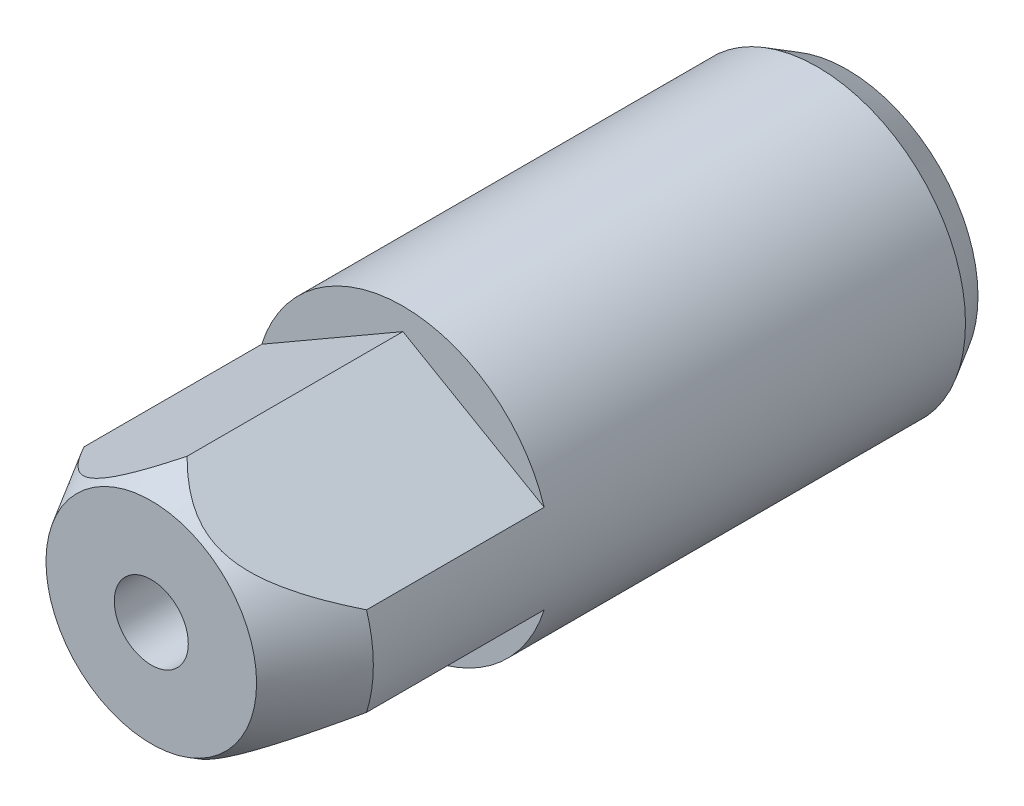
ISO-10303-21;
HEADER;
FILE_DESCRIPTION(('STEP AP214'),'2;1');
FILE_NAME('part.step','',(''),(''),'','','');
FILE_SCHEMA(('AUTOMOTIVE_DESIGN { 1 0 10303 214 1 1 1 1 }'));
ENDSEC;
DATA;
#1=APPLICATION_CONTEXT('core data for automotive mechanical design processes');
#2=APPLICATION_PROTOCOL_DEFINITION('international standard','automotive_design',2000,#1);
#3=PRODUCT_CONTEXT('',#1,'mechanical');
#4=PRODUCT('Part','Part','',(#3));
#5=PRODUCT_RELATED_PRODUCT_CATEGORY('part','',(#4));
#6=PRODUCT_DEFINITION_FORMATION('','',#4);
#7=PRODUCT_DEFINITION_CONTEXT('part definition',#1,'design');
#8=PRODUCT_DEFINITION('design','',#6,#7);
#9=PRODUCT_DEFINITION_SHAPE('','',#8);
#10=(LENGTH_UNIT() NAMED_UNIT(*) SI_UNIT(.MILLI.,.METRE.));
#11=(NAMED_UNIT(*) PLANE_ANGLE_UNIT() SI_UNIT($,.RADIAN.));
#12=(NAMED_UNIT(*) SI_UNIT($,.STERADIAN.) SOLID_ANGLE_UNIT());
#13=UNCERTAINTY_MEASURE_WITH_UNIT(LENGTH_MEASURE(1.E-05),#10,'distance_accuracy_value','');
#14=(GEOMETRIC_REPRESENTATION_CONTEXT(3) GLOBAL_UNCERTAINTY_ASSIGNED_CONTEXT((#13)) GLOBAL_UNIT_ASSIGNED_CONTEXT((#10,
#11,#12)) REPRESENTATION_CONTEXT('',''));
#15=CARTESIAN_POINT('',(0.,0.,0.));
#16=DIRECTION('',(0.,0.,1.));
#17=DIRECTION('',(1.,0.,0.));
#18=AXIS2_PLACEMENT_3D('',#15,#16,#17);
#19=CARTESIAN_POINT('',(0.,0.,42.));
#20=DIRECTION('',(0.,0.,-1.));
#21=DIRECTION('',(-1.,0.,0.));
#22=AXIS2_PLACEMENT_3D('',#19,#20,#21);
#23=CONICAL_SURFACE('',#22,10.,0.523598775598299);
#24=CARTESIAN_POINT('',(0.,0.,47.));
#25=DIRECTION('',(0.,0.,1.));
#26=DIRECTION('',(1.,0.,0.));
#27=AXIS2_PLACEMENT_3D('',#24,#25,#26);
#28=CIRCLE('',#27,7.11324865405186);
#29=CARTESIAN_POINT('',(7.11324865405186,0.,47.));
#30=VERTEX_POINT('',#29);
#31=EDGE_CURVE('E23',#30,#30,#28,.T.);
#32=ORIENTED_EDGE('',*,*,#31,.F.);
#33=EDGE_LOOP('',(#32));
#34=FACE_BOUND('',#33,.T.);
#35=CARTESIAN_POINT('',(-0.000200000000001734,8.50768601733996,44.5847636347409));
#36=CARTESIAN_POINT('',(0.0768470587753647,8.46320287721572,44.661805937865));
#37=CARTESIAN_POINT('',(0.154662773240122,8.41827595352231,44.7378208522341));
#38=CARTESIAN_POINT('',(0.312000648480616,8.32743688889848,44.8875095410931));
#39=CARTESIAN_POINT('',(0.391523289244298,8.28152447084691,44.9611826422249));
#40=CARTESIAN_POINT('',(0.633658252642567,8.14172778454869,45.1789310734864));
#41=CARTESIAN_POINT('',(0.799055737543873,8.04623550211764,45.318944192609));
#42=CARTESIAN_POINT('',(1.14278728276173,7.84778200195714,45.5881294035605));
#43=CARTESIAN_POINT('',(1.32134677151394,7.74469063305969,45.7169212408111));
#44=CARTESIAN_POINT('',(1.6881405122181,7.53292216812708,45.9539744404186));
#45=CARTESIAN_POINT('',(1.87635216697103,7.42425811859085,46.062281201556));
#46=CARTESIAN_POINT('',(2.17463746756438,7.25204301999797,46.2086042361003));
#47=CARTESIAN_POINT('',(2.28121806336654,7.1905086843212,46.256155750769));
#48=CARTESIAN_POINT('',(2.49717050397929,7.06582848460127,46.3420410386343));
#49=CARTESIAN_POINT('',(2.60654255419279,7.00268250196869,46.3803741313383));
#50=CARTESIAN_POINT('',(2.82677321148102,6.87553227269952,46.4463573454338));
#51=CARTESIAN_POINT('',(2.93761320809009,6.81153877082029,46.4740895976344));
#52=CARTESIAN_POINT('',(3.16096019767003,6.68258932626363,46.5182955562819));
#53=CARTESIAN_POINT('',(3.2734668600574,6.61763357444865,46.5347714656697));
#54=CARTESIAN_POINT('',(3.50040245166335,6.48661224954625,46.5559083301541));
#55=CARTESIAN_POINT('',(3.61483947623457,6.42054200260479,46.5604548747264));
#56=CARTESIAN_POINT('',(3.84357858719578,6.28847941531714,46.5572057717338));
#57=CARTESIAN_POINT('',(3.95788067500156,6.22248707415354,46.5494102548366));
#58=CARTESIAN_POINT('',(4.18558028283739,6.09102464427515,46.5217881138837));
#59=CARTESIAN_POINT('',(4.29897587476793,6.02555566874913,46.5019405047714));
#60=CARTESIAN_POINT('',(4.52384684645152,5.89572635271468,46.4509948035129));
#61=CARTESIAN_POINT('',(4.63532193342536,5.8313661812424,46.4198950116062));
#62=CARTESIAN_POINT('',(4.88731264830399,5.68587927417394,46.3371748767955));
#63=CARTESIAN_POINT('',(5.02700902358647,5.60522553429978,46.2822289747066));
#64=CARTESIAN_POINT('',(5.30157192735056,5.4467065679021,46.1581314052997));
#65=CARTESIAN_POINT('',(5.43643639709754,5.36884252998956,46.0889737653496));
#66=CARTESIAN_POINT('',(5.70236736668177,5.21530721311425,45.9382955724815));
#67=CARTESIAN_POINT('',(5.83338784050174,5.13966250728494,45.8566677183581));
#68=CARTESIAN_POINT('',(6.09048029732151,4.99123010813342,45.6837792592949));
#69=CARTESIAN_POINT('',(6.21655351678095,4.91844170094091,45.5925210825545));
#70=CARTESIAN_POINT('',(6.49748169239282,4.75624774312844,45.3765760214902));
#71=CARTESIAN_POINT('',(6.65095427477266,4.66764030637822,45.2495011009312));
#72=CARTESIAN_POINT('',(6.95152770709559,4.49410415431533,44.9856136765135));
#73=CARTESIAN_POINT('',(7.09862566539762,4.4091771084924,44.8487968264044));
#74=CARTESIAN_POINT('',(7.38766692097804,4.24229906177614,44.5671934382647));
#75=CARTESIAN_POINT('',(7.52959445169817,4.16035716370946,44.4223854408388));
#76=CARTESIAN_POINT('',(7.80861429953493,3.99926497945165,44.1267672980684));
#77=CARTESIAN_POINT('',(7.94570740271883,3.92011423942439,43.9759581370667));
#78=CARTESIAN_POINT('',(8.20898045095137,3.76811347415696,43.6771857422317));
#79=CARTESIAN_POINT('',(8.33536282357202,3.6951465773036,43.529459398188));
#80=CARTESIAN_POINT('',(8.5848918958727,3.55108090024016,43.2303946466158));
#81=CARTESIAN_POINT('',(8.70803835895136,3.47998225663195,43.0790559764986));
#82=CARTESIAN_POINT('',(8.95065631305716,3.33990671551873,42.7744450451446));
#83=CARTESIAN_POINT('',(9.07014739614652,3.27091850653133,42.621193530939));
#84=CARTESIAN_POINT('',(9.30664360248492,3.13437735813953,42.3122153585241));
#85=CARTESIAN_POINT('',(9.42364929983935,3.06682408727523,42.1564892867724));
#86=CARTESIAN_POINT('',(9.53959201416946,2.99988452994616,41.99972954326));
#87=B_SPLINE_CURVE_WITH_KNOTS('',3,(#35,#36,#37,#38,#39,#40,#41,#42,#43,#44,#45,#46,#47,#48,#49,
#50,#51,#52,#53,#54,#55,#56,#57,#58,#59,#60,#61,#62,#63,#64,#65,#66,#67,#68,#69,#70,#71,#72,#73,
#74,#75,#76,#77,#78,#79,#80,#81,#82,#83,#84,#85,#86),.UNSPECIFIED.,.F.,.F.,(4,2,2,2,2,2,2,2,2,2,
2,2,2,2,2,2,2,2,2,2,2,2,2,2,2,4),(0.,0.353048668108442,0.706197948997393,1.41609343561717,
2.14459244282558,2.871457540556,3.26696542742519,3.66250250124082,4.05490981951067,
4.4472403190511,4.84332000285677,5.23939549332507,5.63616261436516,6.03298969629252,
6.54338505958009,7.05399536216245,7.56927639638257,8.08442781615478,8.73817972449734,
9.39222514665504,10.0481216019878,10.7039109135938,11.3267950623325,11.9497246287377,
12.5683250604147,13.186781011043),.UNSPECIFIED.);
#88=CARTESIAN_POINT('',(0.,8.50757054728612,44.5849636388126));
#89=VERTEX_POINT('',#88);
#90=CARTESIAN_POINT('',(9.53939201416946,3.,42.));
#91=VERTEX_POINT('',#90);
#92=EDGE_CURVE('E102',#89,#91,#87,.T.);
#93=ORIENTED_EDGE('',*,*,#92,.F.);
#94=CARTESIAN_POINT('',(0.000199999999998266,8.50768601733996,44.5847636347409));
#95=CARTESIAN_POINT('',(-0.0768470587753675,8.46320287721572,44.661805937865));
#96=CARTESIAN_POINT('',(-0.154662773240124,8.41827595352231,44.7378208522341));
#97=CARTESIAN_POINT('',(-0.312000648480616,8.32743688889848,44.8875095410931));
#98=CARTESIAN_POINT('',(-0.3915232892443,8.2815244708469,44.9611826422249));
#99=CARTESIAN_POINT('',(-0.633658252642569,8.14172778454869,45.1789310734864));
#100=CARTESIAN_POINT('',(-0.799055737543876,8.04623550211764,45.318944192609));
#101=CARTESIAN_POINT('',(-1.14278728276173,7.84778200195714,45.5881294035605));
#102=CARTESIAN_POINT('',(-1.32134677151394,7.74469063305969,45.7169212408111));
#103=CARTESIAN_POINT('',(-1.68814051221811,7.53292216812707,45.9539744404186));
#104=CARTESIAN_POINT('',(-1.87635216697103,7.42425811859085,46.062281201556));
#105=CARTESIAN_POINT('',(-2.17463746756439,7.25204301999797,46.2086042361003));
#106=CARTESIAN_POINT('',(-2.28121806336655,7.19050868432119,46.256155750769));
#107=CARTESIAN_POINT('',(-2.49717050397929,7.06582848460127,46.3420410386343));
#108=CARTESIAN_POINT('',(-2.60654255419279,7.00268250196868,46.3803741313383));
#109=CARTESIAN_POINT('',(-2.82677321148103,6.87553227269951,46.4463573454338));
#110=CARTESIAN_POINT('',(-2.9376132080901,6.81153877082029,46.4740895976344));
#111=CARTESIAN_POINT('',(-3.16096019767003,6.68258932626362,46.5182955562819));
#112=CARTESIAN_POINT('',(-3.27346686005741,6.61763357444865,46.5347714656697));
#113=CARTESIAN_POINT('',(-3.50040245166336,6.48661224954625,46.5559083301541));
#114=CARTESIAN_POINT('',(-3.61483947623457,6.42054200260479,46.5604548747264));
#115=CARTESIAN_POINT('',(-3.84357858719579,6.28847941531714,46.5572057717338));
#116=CARTESIAN_POINT('',(-3.95788067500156,6.22248707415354,46.5494102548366));
#117=CARTESIAN_POINT('',(-4.1855802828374,6.09102464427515,46.5217881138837));
#118=CARTESIAN_POINT('',(-4.29897587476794,6.02555566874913,46.5019405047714));
#119=CARTESIAN_POINT('',(-4.52384684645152,5.89572635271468,46.4509948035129));
#120=CARTESIAN_POINT('',(-4.63532193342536,5.8313661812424,46.4198950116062));
#121=CARTESIAN_POINT('',(-4.88731264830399,5.68587927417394,46.3371748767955));
#122=CARTESIAN_POINT('',(-5.02700902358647,5.60522553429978,46.2822289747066));
#123=CARTESIAN_POINT('',(-5.30157192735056,5.44670656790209,46.1581314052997));
#124=CARTESIAN_POINT('',(-5.43643639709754,5.36884252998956,46.0889737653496));
#125=CARTESIAN_POINT('',(-5.70236736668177,5.21530721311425,45.9382955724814));
#126=CARTESIAN_POINT('',(-5.83338784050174,5.13966250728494,45.8566677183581));
#127=CARTESIAN_POINT('',(-6.09048029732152,4.99123010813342,45.6837792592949));
#128=CARTESIAN_POINT('',(-6.21655351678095,4.91844170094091,45.5925210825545));
#129=CARTESIAN_POINT('',(-6.49748169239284,4.75624774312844,45.3765760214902));
#130=CARTESIAN_POINT('',(-6.65095427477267,4.66764030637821,45.2495011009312));
#131=CARTESIAN_POINT('',(-6.95152770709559,4.49410415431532,44.9856136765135));
#132=CARTESIAN_POINT('',(-7.09862566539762,4.4091771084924,44.8487968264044));
#133=CARTESIAN_POINT('',(-7.38766692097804,4.24229906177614,44.5671934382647));
#134=CARTESIAN_POINT('',(-7.52959445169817,4.16035716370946,44.4223854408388));
#135=CARTESIAN_POINT('',(-7.80861429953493,3.99926497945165,44.1267672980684));
#136=CARTESIAN_POINT('',(-7.94570740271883,3.92011423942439,43.9759581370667));
#137=CARTESIAN_POINT('',(-8.20898045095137,3.76811347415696,43.6771857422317));
#138=CARTESIAN_POINT('',(-8.33536282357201,3.6951465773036,43.529459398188));
#139=CARTESIAN_POINT('',(-8.5848918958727,3.55108090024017,43.2303946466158));
#140=CARTESIAN_POINT('',(-8.70803835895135,3.47998225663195,43.0790559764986));
#141=CARTESIAN_POINT('',(-8.95065631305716,3.33990671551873,42.7744450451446));
#142=CARTESIAN_POINT('',(-9.07014739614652,3.27091850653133,42.621193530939));
#143=CARTESIAN_POINT('',(-9.30664360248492,3.13437735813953,42.3122153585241));
#144=CARTESIAN_POINT('',(-9.42364929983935,3.06682408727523,42.1564892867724));
#145=CARTESIAN_POINT('',(-9.53959201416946,2.99988452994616,41.99972954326));
#146=B_SPLINE_CURVE_WITH_KNOTS('',3,(#94,#95,#96,#97,#98,#99,#100,#101,#102,#103,#104,#105,#106,
#107,#108,#109,#110,#111,#112,#113,#114,#115,#116,#117,#118,#119,#120,#121,#122,#123,#124,#125,
#126,#127,#128,#129,#130,#131,#132,#133,#134,#135,#136,#137,#138,#139,#140,#141,#142,#143,#144,
#145),.UNSPECIFIED.,.F.,.F.,(4,2,2,2,2,2,2,2,2,2,2,2,2,2,2,2,2,2,2,2,2,2,2,2,2,4),(0.,
0.35304866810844,0.706197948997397,1.41609343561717,2.14459244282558,2.871457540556,
3.2669654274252,3.66250250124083,4.05490981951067,4.44724031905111,4.84332000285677,
5.23939549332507,5.63616261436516,6.03298969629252,6.54338505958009,7.05399536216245,
7.56927639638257,8.08442781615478,8.73817972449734,9.39222514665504,10.0481216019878,
10.7039109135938,11.3267950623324,11.9497246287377,12.5683250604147,13.186781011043),.UNSPECIFIED.);
#147=CARTESIAN_POINT('',(-9.53939201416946,3.,42.));
#148=VERTEX_POINT('',#147);
#149=EDGE_CURVE('E75',#89,#148,#146,.T.);
#150=ORIENTED_EDGE('',*,*,#149,.T.);
#151=CARTESIAN_POINT('',(0.,0.,42.));
#152=DIRECTION('',(0.,0.,1.));
#153=DIRECTION('',(1.,0.,0.));
#154=AXIS2_PLACEMENT_3D('',#151,#152,#153);
#155=CIRCLE('',#154,10.);
#156=CARTESIAN_POINT('',(-9.53939201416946,-3.,42.));
#157=VERTEX_POINT('',#156);
#158=EDGE_CURVE('E155',#148,#157,#155,.T.);
#159=ORIENTED_EDGE('',*,*,#158,.T.);
#160=CARTESIAN_POINT('',(0.0001999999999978,-8.50768601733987,44.5847636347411));
#161=CARTESIAN_POINT('',(-0.0768470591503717,-8.46320287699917,44.66180593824));
#162=CARTESIAN_POINT('',(-0.154662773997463,-8.41827595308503,44.7378208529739));
#163=CARTESIAN_POINT('',(-0.312000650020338,-8.32743688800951,44.8875095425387));
#164=CARTESIAN_POINT('',(-0.391523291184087,-8.28152446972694,44.9611826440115));
#165=CARTESIAN_POINT('',(-0.633658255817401,-8.14172778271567,45.1789310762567));
#166=CARTESIAN_POINT('',(-0.799055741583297,-8.04623549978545,45.3189441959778));
#167=CARTESIAN_POINT('',(-1.1427872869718,-7.84778199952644,45.5881294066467));
#168=CARTESIAN_POINT('',(-1.32134677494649,-7.7446906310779,45.7169212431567));
#169=CARTESIAN_POINT('',(-1.68814051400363,-7.53292216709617,45.953974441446));
#170=CARTESIAN_POINT('',(-1.87635216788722,-7.42425811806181,46.0622812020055));
#171=CARTESIAN_POINT('',(-2.17463746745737,-7.2520430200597,46.2086042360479));
#172=CARTESIAN_POINT('',(-2.28121806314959,-7.19050868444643,46.2561557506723));
#173=CARTESIAN_POINT('',(-2.49717050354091,-7.06582848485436,46.3420410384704));
#174=CARTESIAN_POINT('',(-2.60654255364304,-7.00268250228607,46.3803741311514));
#175=CARTESIAN_POINT('',(-2.82677321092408,-6.87553227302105,46.446357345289));
#176=CARTESIAN_POINT('',(-2.93761320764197,-6.811538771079,46.4740895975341));
#177=CARTESIAN_POINT('',(-3.16096019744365,-6.6825893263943,46.5182955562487));
#178=CARTESIAN_POINT('',(-3.27346685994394,-6.61763357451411,46.5347714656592));
#179=CARTESIAN_POINT('',(-3.50040245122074,-6.48661224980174,46.555908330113));
#180=CARTESIAN_POINT('',(-3.61483947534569,-6.42054200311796,46.5604548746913));
#181=CARTESIAN_POINT('',(-3.84357858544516,-6.28847941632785,46.5572057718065));
#182=CARTESIAN_POINT('',(-3.95788067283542,-6.22248707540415,46.5494102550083));
#183=CARTESIAN_POINT('',(-4.18558028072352,-6.09102464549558,46.5217881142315));
#184=CARTESIAN_POINT('',(-4.29897587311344,-6.02555566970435,46.5019405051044));
#185=CARTESIAN_POINT('',(-4.5238468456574,-5.89572635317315,46.4509948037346));
#186=CARTESIAN_POINT('',(-4.63532193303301,-5.83136618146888,46.4198950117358));
#187=CARTESIAN_POINT('',(-4.887312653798,-5.68587927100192,46.337174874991));
#188=CARTESIAN_POINT('',(-5.02700903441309,-5.60522552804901,46.2822289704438));
#189=CARTESIAN_POINT('',(-5.30157194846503,-5.44670655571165,46.1581313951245));
#190=CARTESIAN_POINT('',(-5.43643642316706,-5.36884251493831,46.0889737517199));
#191=CARTESIAN_POINT('',(-5.70236739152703,-5.21530719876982,45.9382955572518));
#192=CARTESIAN_POINT('',(-5.83338785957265,-5.13966249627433,45.8566677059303));
#193=CARTESIAN_POINT('',(-6.09048030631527,-4.99123010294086,45.6837792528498));
#194=CARTESIAN_POINT('',(-6.21655352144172,-4.91844169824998,45.5925210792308));
#195=CARTESIAN_POINT('',(-6.49747874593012,-4.75624944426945,45.376578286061));
#196=CARTESIAN_POINT('',(-6.65094851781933,-4.66764363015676,45.2495058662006));
#197=CARTESIAN_POINT('',(-6.95151655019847,-4.49411059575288,44.9856237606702));
#198=CARTESIAN_POINT('',(-7.09861191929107,-4.40918504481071,44.8488097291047));
#199=CARTESIAN_POINT('',(-7.38764815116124,-4.24230989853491,44.5672122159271));
#200=CARTESIAN_POINT('',(-7.52957324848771,-4.16036940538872,44.4224072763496));
#201=CARTESIAN_POINT('',(-7.80858837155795,-3.99927994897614,44.1267953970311));
#202=CARTESIAN_POINT('',(-7.94567918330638,-3.92013053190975,43.9759894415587));
#203=CARTESIAN_POINT('',(-8.20894803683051,-3.76813218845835,43.6772232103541));
#204=CARTESIAN_POINT('',(-8.33532849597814,-3.69516639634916,43.5294998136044));
#205=CARTESIAN_POINT('',(-8.58485381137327,-3.55110288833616,43.2304410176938));
#206=CARTESIAN_POINT('',(-8.70799843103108,-3.48000530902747,43.0791053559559));
#207=CARTESIAN_POINT('',(-8.95061279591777,-3.33993184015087,42.7745004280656));
#208=CARTESIAN_POINT('',(-9.07010213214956,-3.27094463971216,42.6212519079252));
#209=CARTESIAN_POINT('',(-9.30659488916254,-3.13440548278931,42.3122797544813));
#210=CARTESIAN_POINT('',(-9.42359888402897,-3.06685319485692,42.1565567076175));
#211=CARTESIAN_POINT('',(-9.53953991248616,-2.99991461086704,41.9998));
#212=B_SPLINE_CURVE_WITH_KNOTS('',3,(#160,#161,#162,#163,#164,#165,#166,#167,#168,#169,#170,
#171,#172,#173,#174,#175,#176,#177,#178,#179,#180,#181,#182,#183,#184,#185,#186,#187,#188,#189,
#190,#191,#192,#193,#194,#195,#196,#197,#198,#199,#200,#201,#202,#203,#204,#205,#206,#207,#208,
#209,#210,#211),.UNSPECIFIED.,.F.,.F.,(4,2,2,2,2,2,2,2,2,2,2,2,2,2,2,2,2,2,2,2,2,2,2,2,2,4),(0.,
0.353048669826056,0.706197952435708,1.41609344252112,2.14459244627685,2.87145754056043,
3.26696542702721,3.66250250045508,4.05490981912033,4.44724031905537,4.84332000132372,
5.23939549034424,5.63616261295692,6.03298969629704,6.54338507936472,7.0539954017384,
7.56927641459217,8.08442781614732,8.73816746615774,9.39220061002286,10.0480846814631,
10.7038616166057,11.3267348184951,11.9496534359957,12.5682431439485,13.1866883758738),.UNSPECIFIED.);
#213=CARTESIAN_POINT('',(0.,-8.50757054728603,44.5849636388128));
#214=VERTEX_POINT('',#213);
#215=EDGE_CURVE('E129',#214,#157,#212,.T.);
#216=ORIENTED_EDGE('',*,*,#215,.F.);
#217=CARTESIAN_POINT('',(-0.000200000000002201,-8.50768601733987,44.5847636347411));
#218=CARTESIAN_POINT('',(0.0768470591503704,-8.46320287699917,44.66180593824));
#219=CARTESIAN_POINT('',(0.154662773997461,-8.41827595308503,44.7378208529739));
#220=CARTESIAN_POINT('',(0.312000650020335,-8.32743688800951,44.8875095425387));
#221=CARTESIAN_POINT('',(0.391523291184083,-8.28152446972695,44.9611826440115));
#222=CARTESIAN_POINT('',(0.633658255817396,-8.14172778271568,45.1789310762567));
#223=CARTESIAN_POINT('',(0.799055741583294,-8.04623549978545,45.3189441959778));
#224=CARTESIAN_POINT('',(1.14278728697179,-7.84778199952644,45.5881294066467));
#225=CARTESIAN_POINT('',(1.32134677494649,-7.7446906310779,45.7169212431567));
#226=CARTESIAN_POINT('',(1.68814051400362,-7.53292216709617,45.953974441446));
#227=CARTESIAN_POINT('',(1.87635216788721,-7.42425811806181,46.0622812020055));
#228=CARTESIAN_POINT('',(2.17463746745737,-7.2520430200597,46.2086042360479));
#229=CARTESIAN_POINT('',(2.28121806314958,-7.19050868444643,46.2561557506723));
#230=CARTESIAN_POINT('',(2.49717050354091,-7.06582848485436,46.3420410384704));
#231=CARTESIAN_POINT('',(2.60654255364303,-7.00268250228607,46.3803741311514));
#232=CARTESIAN_POINT('',(2.82677321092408,-6.87553227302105,46.446357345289));
#233=CARTESIAN_POINT('',(2.93761320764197,-6.811538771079,46.4740895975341));
#234=CARTESIAN_POINT('',(3.16096019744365,-6.6825893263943,46.5182955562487));
#235=CARTESIAN_POINT('',(3.27346685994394,-6.61763357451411,46.5347714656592));
#236=CARTESIAN_POINT('',(3.50040245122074,-6.48661224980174,46.555908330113));
#237=CARTESIAN_POINT('',(3.61483947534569,-6.42054200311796,46.5604548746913));
#238=CARTESIAN_POINT('',(3.84357858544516,-6.28847941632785,46.5572057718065));
#239=CARTESIAN_POINT('',(3.95788067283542,-6.22248707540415,46.5494102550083));
#240=CARTESIAN_POINT('',(4.18558028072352,-6.09102464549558,46.5217881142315));
#241=CARTESIAN_POINT('',(4.29897587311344,-6.02555566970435,46.5019405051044));
#242=CARTESIAN_POINT('',(4.5238468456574,-5.89572635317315,46.4509948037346));
#243=CARTESIAN_POINT('',(4.63532193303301,-5.83136618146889,46.4198950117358));
#244=CARTESIAN_POINT('',(4.887312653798,-5.68587927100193,46.337174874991));
#245=CARTESIAN_POINT('',(5.02700903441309,-5.60522552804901,46.2822289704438));
#246=CARTESIAN_POINT('',(5.30157194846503,-5.44670655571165,46.1581313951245));
#247=CARTESIAN_POINT('',(5.43643642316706,-5.36884251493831,46.0889737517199));
#248=CARTESIAN_POINT('',(5.70236739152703,-5.21530719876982,45.9382955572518));
#249=CARTESIAN_POINT('',(5.83338785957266,-5.13966249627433,45.8566677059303));
#250=CARTESIAN_POINT('',(6.09048030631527,-4.99123010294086,45.6837792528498));
#251=CARTESIAN_POINT('',(6.21655352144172,-4.91844169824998,45.5925210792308));
#252=CARTESIAN_POINT('',(6.49747874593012,-4.75624944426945,45.376578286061));
#253=CARTESIAN_POINT('',(6.65094851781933,-4.66764363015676,45.2495058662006));
#254=CARTESIAN_POINT('',(6.95151655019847,-4.49411059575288,44.9856237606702));
#255=CARTESIAN_POINT('',(7.09861191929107,-4.40918504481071,44.8488097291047));
#256=CARTESIAN_POINT('',(7.38764815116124,-4.24230989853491,44.5672122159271));
#257=CARTESIAN_POINT('',(7.52957324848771,-4.16036940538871,44.4224072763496));
#258=CARTESIAN_POINT('',(7.80858837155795,-3.99927994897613,44.1267953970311));
#259=CARTESIAN_POINT('',(7.94567918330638,-3.92013053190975,43.9759894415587));
#260=CARTESIAN_POINT('',(8.20894803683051,-3.76813218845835,43.6772232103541));
#261=CARTESIAN_POINT('',(8.33532849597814,-3.69516639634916,43.5294998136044));
#262=CARTESIAN_POINT('',(8.58485381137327,-3.55110288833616,43.2304410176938));
#263=CARTESIAN_POINT('',(8.70799843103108,-3.48000530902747,43.0791053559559));
#264=CARTESIAN_POINT('',(8.95061279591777,-3.33993184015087,42.7745004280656));
#265=CARTESIAN_POINT('',(9.07010213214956,-3.27094463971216,42.6212519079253));
#266=CARTESIAN_POINT('',(9.30659488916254,-3.13440548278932,42.3122797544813));
#267=CARTESIAN_POINT('',(9.42359888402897,-3.06685319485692,42.1565567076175));
#268=CARTESIAN_POINT('',(9.53953991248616,-2.99991461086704,41.9998));
#269=B_SPLINE_CURVE_WITH_KNOTS('',3,(#217,#218,#219,#220,#221,#222,#223,#224,#225,#226,#227,
#228,#229,#230,#231,#232,#233,#234,#235,#236,#237,#238,#239,#240,#241,#242,#243,#244,#245,#246,
#247,#248,#249,#250,#251,#252,#253,#254,#255,#256,#257,#258,#259,#260,#261,#262,#263,#264,#265,
#266,#267,#268),.UNSPECIFIED.,.F.,.F.,(4,2,2,2,2,2,2,2,2,2,2,2,2,2,2,2,2,2,2,2,2,2,2,2,2,4),(0.,
0.353048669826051,0.706197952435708,1.41609344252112,2.14459244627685,2.87145754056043,
3.2669654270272,3.66250250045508,4.05490981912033,4.44724031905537,4.84332000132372,
5.23939549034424,5.63616261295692,6.03298969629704,6.54338507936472,7.0539954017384,
7.56927641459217,8.08442781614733,8.73816746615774,9.39220061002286,10.0480846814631,
10.7038616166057,11.3267348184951,11.9496534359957,12.5682431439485,13.1866883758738),.UNSPECIFIED.);
#270=CARTESIAN_POINT('',(9.53939201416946,-3.,42.));
#271=VERTEX_POINT('',#270);
#272=EDGE_CURVE('E138',#214,#271,#269,.T.);
#273=ORIENTED_EDGE('',*,*,#272,.T.);
#274=EDGE_CURVE('E156',#271,#91,#155,.T.);
#275=ORIENTED_EDGE('',*,*,#274,.T.);
#276=EDGE_LOOP('',(#93,#150,#159,#216,#273,#275));
#277=FACE_BOUND('',#276,.T.);
#278=ADVANCED_FACE('F15',(#34,#277),#23,.T.);
#279=CARTESIAN_POINT('',(0.,0.,30.));
#280=DIRECTION('',(0.,0.,1.));
#281=DIRECTION('',(1.,0.,0.));
#282=AXIS2_PLACEMENT_3D('',#279,#280,#281);
#283=CYLINDRICAL_SURFACE('',#282,10.);
#284=CARTESIAN_POINT('',(0.,0.,2.));
#285=DIRECTION('',(0.,0.,1.));
#286=DIRECTION('',(1.,0.,0.));
#287=AXIS2_PLACEMENT_3D('',#284,#285,#286);
#288=CIRCLE('',#287,10.);
#289=CARTESIAN_POINT('',(10.,0.,2.));
#290=VERTEX_POINT('',#289);
#291=EDGE_CURVE('E152',#290,#290,#288,.T.);
#292=ORIENTED_EDGE('',*,*,#291,.T.);
#293=EDGE_LOOP('',(#292));
#294=FACE_BOUND('',#293,.T.);
#295=DIRECTION('',(0.,0.,1.));
#296=VECTOR('',#295,1.);
#297=CARTESIAN_POINT('',(9.53939201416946,3.,30.));
#298=LINE('',#297,#296);
#299=CARTESIAN_POINT('',(9.53939201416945,3.,30.));
#300=VERTEX_POINT('',#299);
#301=EDGE_CURVE('E82',#300,#91,#298,.T.);
#302=ORIENTED_EDGE('',*,*,#301,.T.);
#303=ORIENTED_EDGE('',*,*,#274,.F.);
#304=DIRECTION('',(0.,0.,1.));
#305=VECTOR('',#304,1.);
#306=CARTESIAN_POINT('',(9.53939201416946,-3.,30.));
#307=LINE('',#306,#305);
#308=CARTESIAN_POINT('',(9.53939201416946,-3.,30.));
#309=VERTEX_POINT('',#308);
#310=EDGE_CURVE('E179',#309,#271,#307,.T.);
#311=ORIENTED_EDGE('',*,*,#310,.F.);
#312=CARTESIAN_POINT('',(0.,0.,30.));
#313=DIRECTION('',(0.,0.,1.));
#314=DIRECTION('',(1.,0.,0.));
#315=AXIS2_PLACEMENT_3D('',#312,#313,#314);
#316=CIRCLE('',#315,10.);
#317=CARTESIAN_POINT('',(-9.53939201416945,-3.,30.));
#318=VERTEX_POINT('',#317);
#319=EDGE_CURVE('E169',#318,#309,#316,.T.);
#320=ORIENTED_EDGE('',*,*,#319,.F.);
#321=DIRECTION('',(0.,0.,1.));
#322=VECTOR('',#321,1.);
#323=CARTESIAN_POINT('',(-9.53939201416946,-3.,30.));
#324=LINE('',#323,#322);
#325=EDGE_CURVE('E176',#318,#157,#324,.T.);
#326=ORIENTED_EDGE('',*,*,#325,.T.);
#327=ORIENTED_EDGE('',*,*,#158,.F.);
#328=DIRECTION('',(0.,0.,1.));
#329=VECTOR('',#328,1.);
#330=CARTESIAN_POINT('',(-9.53939201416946,3.,30.));
#331=LINE('',#330,#329);
#332=CARTESIAN_POINT('',(-9.53939201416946,3.,30.));
#333=VERTEX_POINT('',#332);
#334=EDGE_CURVE('E78',#333,#148,#331,.T.);
#335=ORIENTED_EDGE('',*,*,#334,.F.);
#336=CARTESIAN_POINT('',(0.,0.,30.));
#337=DIRECTION('',(0.,0.,1.));
#338=DIRECTION('',(1.,0.,0.));
#339=AXIS2_PLACEMENT_3D('',#336,#337,#338);
#340=CIRCLE('',#339,10.);
#341=EDGE_CURVE('E86',#300,#333,#340,.T.);
#342=ORIENTED_EDGE('',*,*,#341,.F.);
#343=EDGE_LOOP('',(#302,#303,#311,#320,#326,#327,#335,#342));
#344=FACE_BOUND('',#343,.T.);
#345=ADVANCED_FACE('F165',(#294,#344),#283,.T.);
#346=CARTESIAN_POINT('',(0.,0.,30.));
#347=DIRECTION('',(0.,0.,1.));
#348=DIRECTION('',(1.,0.,0.));
#349=AXIS2_PLACEMENT_3D('',#346,#347,#348);
#350=CYLINDRICAL_SURFACE('',#349,2.5);
#351=CARTESIAN_POINT('',(0.,0.,37.));
#352=DIRECTION('',(0.,0.,1.));
#353=DIRECTION('',(1.,0.,0.));
#354=AXIS2_PLACEMENT_3D('',#351,#352,#353);
#355=CIRCLE('',#354,2.5);
#356=CARTESIAN_POINT('',(2.5,0.,37.));
#357=VERTEX_POINT('',#356);
#358=EDGE_CURVE('E89',#357,#357,#355,.T.);
#359=ORIENTED_EDGE('',*,*,#358,.F.);
#360=EDGE_LOOP('',(#359));
#361=FACE_BOUND('',#360,.T.);
#362=CARTESIAN_POINT('',(0.,0.,47.));
#363=DIRECTION('',(0.,0.,1.));
#364=DIRECTION('',(1.,0.,0.));
#365=AXIS2_PLACEMENT_3D('',#362,#363,#364);
#366=CIRCLE('',#365,2.5);
#367=CARTESIAN_POINT('',(2.5,0.,47.));
#368=VERTEX_POINT('',#367);
#369=EDGE_CURVE('E9',#368,#368,#366,.T.);
#370=ORIENTED_EDGE('',*,*,#369,.T.);
#371=EDGE_LOOP('',(#370));
#372=FACE_BOUND('',#371,.T.);
#373=ADVANCED_FACE('F17',(#361,#372),#350,.F.);
#374=CARTESIAN_POINT('',(7.11324865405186,0.,47.));
#375=DIRECTION('',(0.,0.,-1.));
#376=DIRECTION('',(-1.,0.,0.));
#377=AXIS2_PLACEMENT_3D('',#374,#375,#376);
#378=PLANE('',#377);
#379=ORIENTED_EDGE('',*,*,#369,.F.);
#380=EDGE_LOOP('',(#379));
#381=FACE_BOUND('',#380,.T.);
#382=ORIENTED_EDGE('',*,*,#31,.T.);
#383=EDGE_LOOP('',(#382));
#384=FACE_BOUND('',#383,.T.);
#385=ADVANCED_FACE('F161',(#381,#384),#378,.F.);
#386=CARTESIAN_POINT('',(0.,0.,0.));
#387=DIRECTION('',(0.,0.,1.));
#388=DIRECTION('',(1.,0.,0.));
#389=AXIS2_PLACEMENT_3D('',#386,#387,#388);
#390=CONICAL_SURFACE('',#389,8.84529946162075,0.523598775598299);
#391=ORIENTED_EDGE('',*,*,#291,.F.);
#392=EDGE_LOOP('',(#391));
#393=FACE_BOUND('',#392,.T.);
#394=CARTESIAN_POINT('',(0.,0.,0.));
#395=DIRECTION('',(0.,0.,1.));
#396=DIRECTION('',(1.,0.,0.));
#397=AXIS2_PLACEMENT_3D('',#394,#395,#396);
#398=CIRCLE('',#397,8.84529946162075);
#399=CARTESIAN_POINT('',(8.84529946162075,0.,0.));
#400=VERTEX_POINT('',#399);
#401=EDGE_CURVE('E149',#400,#400,#398,.T.);
#402=ORIENTED_EDGE('',*,*,#401,.T.);
#403=EDGE_LOOP('',(#402));
#404=FACE_BOUND('',#403,.T.);
#405=ADVANCED_FACE('F252',(#393,#404),#390,.T.);
#406=CARTESIAN_POINT('',(1.,0.,0.));
#407=DIRECTION('',(0.,0.,1.));
#408=DIRECTION('',(1.,0.,0.));
#409=AXIS2_PLACEMENT_3D('',#406,#407,#408);
#410=PLANE('',#409);
#411=ORIENTED_EDGE('',*,*,#401,.F.);
#412=EDGE_LOOP('',(#411));
#413=FACE_BOUND('',#412,.T.);
#414=CARTESIAN_POINT('',(0.,0.,0.));
#415=DIRECTION('',(0.,0.,1.));
#416=DIRECTION('',(1.,0.,0.));
#417=AXIS2_PLACEMENT_3D('',#414,#415,#416);
#418=CIRCLE('',#417,1.);
#419=CARTESIAN_POINT('',(1.,0.,0.));
#420=VERTEX_POINT('',#419);
#421=EDGE_CURVE('E146',#420,#420,#418,.T.);
#422=ORIENTED_EDGE('',*,*,#421,.T.);
#423=EDGE_LOOP('',(#422));
#424=FACE_BOUND('',#423,.T.);
#425=ADVANCED_FACE('F257',(#413,#424),#410,.F.);
#426=CARTESIAN_POINT('',(0.,0.,30.));
#427=DIRECTION('',(0.,0.,1.));
#428=DIRECTION('',(1.,0.,0.));
#429=AXIS2_PLACEMENT_3D('',#426,#427,#428);
#430=CYLINDRICAL_SURFACE('',#429,1.);
#431=ORIENTED_EDGE('',*,*,#421,.F.);
#432=EDGE_LOOP('',(#431));
#433=FACE_BOUND('',#432,.T.);
#434=CARTESIAN_POINT('',(0.,0.,4.));
#435=DIRECTION('',(0.,0.,1.));
#436=DIRECTION('',(1.,0.,0.));
#437=AXIS2_PLACEMENT_3D('',#434,#435,#436);
#438=CIRCLE('',#437,1.);
#439=CARTESIAN_POINT('',(1.,0.,4.));
#440=VERTEX_POINT('',#439);
#441=EDGE_CURVE('E137',#440,#440,#438,.T.);
#442=ORIENTED_EDGE('',*,*,#441,.T.);
#443=EDGE_LOOP('',(#442));
#444=FACE_BOUND('',#443,.T.);
#445=ADVANCED_FACE('F266',(#433,#444),#430,.F.);
#446=CARTESIAN_POINT('',(0.,0.,4.));
#447=DIRECTION('',(0.,0.,1.));
#448=DIRECTION('',(1.,0.,0.));
#449=AXIS2_PLACEMENT_3D('',#446,#447,#448);
#450=PLANE('',#449);
#451=ORIENTED_EDGE('',*,*,#441,.F.);
#452=EDGE_LOOP('',(#451));
#453=FACE_BOUND('',#452,.T.);
#454=ADVANCED_FACE('F124',(#453),#450,.F.);
#455=CARTESIAN_POINT('',(-9.53939201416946,-3.,30.));
#456=DIRECTION('',(-0.5,-0.866025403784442,0.));
#457=DIRECTION('',(0.866025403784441,-0.5,0.));
#458=AXIS2_PLACEMENT_3D('',#455,#456,#457);
#459=PLANE('',#458);
#460=ORIENTED_EDGE('',*,*,#215,.T.);
#461=ORIENTED_EDGE('',*,*,#325,.F.);
#462=DIRECTION('',(0.866025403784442,-0.5,0.));
#463=VECTOR('',#462,1.);
#464=CARTESIAN_POINT('',(-9.53939201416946,-3.,30.));
#465=LINE('',#464,#463);
#466=CARTESIAN_POINT('',(0.,-8.50757054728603,30.));
#467=VERTEX_POINT('',#466);
#468=EDGE_CURVE('E38',#318,#467,#465,.T.);
#469=ORIENTED_EDGE('',*,*,#468,.T.);
#470=DIRECTION('',(0.,0.,1.));
#471=VECTOR('',#470,1.);
#472=CARTESIAN_POINT('',(0.,-8.50757054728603,30.));
#473=LINE('',#472,#471);
#474=EDGE_CURVE('E180',#467,#214,#473,.T.);
#475=ORIENTED_EDGE('',*,*,#474,.T.);
#476=EDGE_LOOP('',(#460,#461,#469,#475));
#477=FACE_BOUND('',#476,.T.);
#478=ADVANCED_FACE('F120',(#477),#459,.T.);
#479=CARTESIAN_POINT('',(9.53939201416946,-3.,30.));
#480=DIRECTION('',(-0.5,0.866025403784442,0.));
#481=DIRECTION('',(-0.866025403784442,-0.5,0.));
#482=AXIS2_PLACEMENT_3D('',#479,#480,#481);
#483=PLANE('',#482);
#484=ORIENTED_EDGE('',*,*,#474,.F.);
#485=DIRECTION('',(-0.866025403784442,-0.5,0.));
#486=VECTOR('',#485,1.);
#487=CARTESIAN_POINT('',(9.53939201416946,-3.,30.));
#488=LINE('',#487,#486);
#489=EDGE_CURVE('E170',#309,#467,#488,.T.);
#490=ORIENTED_EDGE('',*,*,#489,.F.);
#491=ORIENTED_EDGE('',*,*,#310,.T.);
#492=ORIENTED_EDGE('',*,*,#272,.F.);
#493=EDGE_LOOP('',(#484,#490,#491,#492));
#494=FACE_BOUND('',#493,.T.);
#495=ADVANCED_FACE('F119',(#494),#483,.F.);
#496=CARTESIAN_POINT('',(0.,0.,30.));
#497=DIRECTION('',(0.,0.,1.));
#498=DIRECTION('',(1.,0.,0.));
#499=AXIS2_PLACEMENT_3D('',#496,#497,#498);
#500=PLANE('',#499);
#501=ORIENTED_EDGE('',*,*,#468,.F.);
#502=ORIENTED_EDGE('',*,*,#319,.T.);
#503=ORIENTED_EDGE('',*,*,#489,.T.);
#504=EDGE_LOOP('',(#501,#502,#503));
#505=FACE_BOUND('',#504,.T.);
#506=ADVANCED_FACE('F116',(#505),#500,.T.);
#507=CARTESIAN_POINT('',(9.53939201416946,3.,30.));
#508=DIRECTION('',(0.5,0.866025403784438,0.));
#509=DIRECTION('',(-0.866025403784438,0.5,0.));
#510=AXIS2_PLACEMENT_3D('',#507,#508,#509);
#511=PLANE('',#510);
#512=ORIENTED_EDGE('',*,*,#92,.T.);
#513=ORIENTED_EDGE('',*,*,#301,.F.);
#514=DIRECTION('',(-0.866025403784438,0.5,0.));
#515=VECTOR('',#514,1.);
#516=CARTESIAN_POINT('',(9.53939201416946,3.,30.));
#517=LINE('',#516,#515);
#518=CARTESIAN_POINT('',(0.,8.50757054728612,30.));
#519=VERTEX_POINT('',#518);
#520=EDGE_CURVE('E30',#300,#519,#517,.T.);
#521=ORIENTED_EDGE('',*,*,#520,.T.);
#522=DIRECTION('',(0.,0.,1.));
#523=VECTOR('',#522,1.);
#524=CARTESIAN_POINT('',(0.,8.50757054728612,30.));
#525=LINE('',#524,#523);
#526=EDGE_CURVE('E71',#519,#89,#525,.T.);
#527=ORIENTED_EDGE('',*,*,#526,.T.);
#528=EDGE_LOOP('',(#512,#513,#521,#527));
#529=FACE_BOUND('',#528,.T.);
#530=ADVANCED_FACE('F80',(#529),#511,.T.);
#531=CARTESIAN_POINT('',(-9.53939201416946,3.,30.));
#532=DIRECTION('',(0.5,-0.866025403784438,0.));
#533=DIRECTION('',(0.866025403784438,0.5,0.));
#534=AXIS2_PLACEMENT_3D('',#531,#532,#533);
#535=PLANE('',#534);
#536=ORIENTED_EDGE('',*,*,#526,.F.);
#537=DIRECTION('',(0.866025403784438,0.5,0.));
#538=VECTOR('',#537,1.);
#539=CARTESIAN_POINT('',(-9.53939201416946,3.,30.));
#540=LINE('',#539,#538);
#541=EDGE_CURVE('E73',#333,#519,#540,.T.);
#542=ORIENTED_EDGE('',*,*,#541,.F.);
#543=ORIENTED_EDGE('',*,*,#334,.T.);
#544=ORIENTED_EDGE('',*,*,#149,.F.);
#545=EDGE_LOOP('',(#536,#542,#543,#544));
#546=FACE_BOUND('',#545,.T.);
#547=ADVANCED_FACE('F72',(#546),#535,.F.);
#548=CARTESIAN_POINT('',(0.,0.,30.));
#549=DIRECTION('',(0.,0.,1.));
#550=DIRECTION('',(1.,0.,0.));
#551=AXIS2_PLACEMENT_3D('',#548,#549,#550);
#552=PLANE('',#551);
#553=ORIENTED_EDGE('',*,*,#520,.F.);
#554=ORIENTED_EDGE('',*,*,#341,.T.);
#555=ORIENTED_EDGE('',*,*,#541,.T.);
#556=EDGE_LOOP('',(#553,#554,#555));
#557=FACE_BOUND('',#556,.T.);
#558=ADVANCED_FACE('F85',(#557),#552,.T.);
#559=CARTESIAN_POINT('',(0.,0.,37.));
#560=DIRECTION('',(0.,0.,1.));
#561=DIRECTION('',(1.,0.,0.));
#562=AXIS2_PLACEMENT_3D('',#559,#560,#561);
#563=PLANE('',#562);
#564=ORIENTED_EDGE('',*,*,#358,.T.);
#565=EDGE_LOOP('',(#564));
#566=FACE_BOUND('',#565,.T.);
#567=ADVANCED_FACE('F217',(#566),#563,.T.);
#568=CLOSED_SHELL('',(#278,#345,#373,#385,#405,#425,#445,#454,#478,#495,#506,#530,#547,#558,#567));
#569=MANIFOLD_SOLID_BREP('B1',#568);
#570=ADVANCED_BREP_SHAPE_REPRESENTATION('',(#18,#569),#14);
#571=SHAPE_DEFINITION_REPRESENTATION(#9,#570);
ENDSEC;
END-ISO-10303-21;
